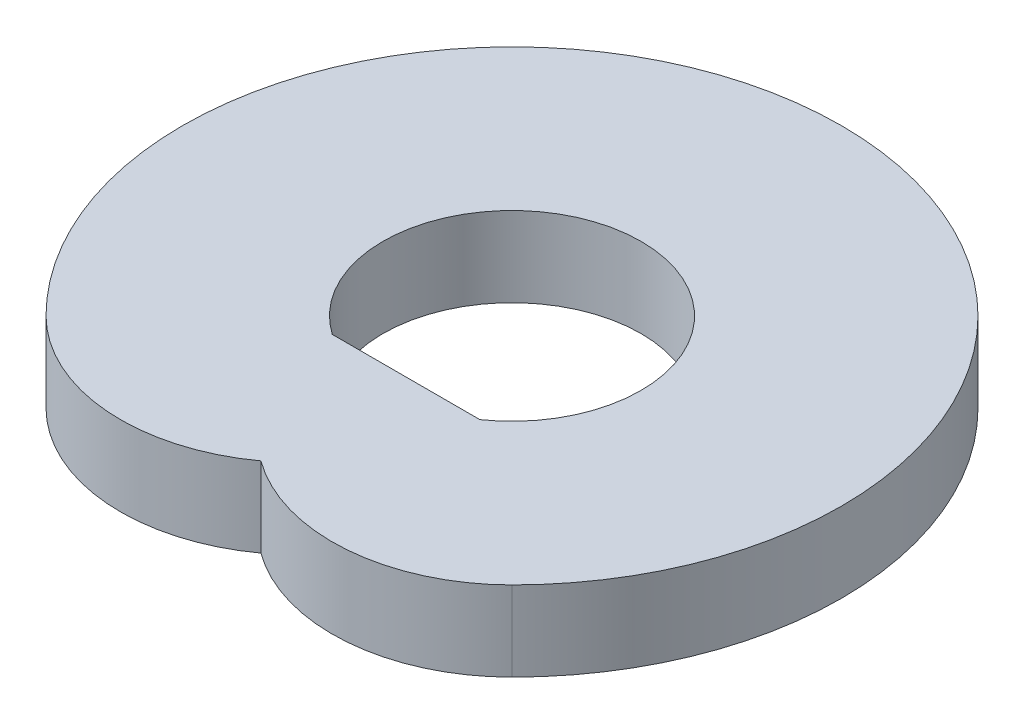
from build123d import *

# Parameters (mm, degrees)
EXTRUDE_1_DEPTH = 200


with BuildPart() as part:
    # Sketch 1 → Extrude 1 (new body)
    with BuildSketch(Plane(origin=(0, 0, 0), x_dir=(1, 0, 0), z_dir=(0, 1, 0))):
        with BuildLine():
            ThreePointArc((583.363094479, -583.363094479), (0, 825), (-583.363094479, -583.363094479))
            ThreePointArc((-583.363094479, -583.363094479), (-300.063671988, -713.809763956), (0, -628.741032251))
            ThreePointArc((0, -628.741032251), (300.063671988, -713.809763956), (583.363094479, -583.363094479))
        make_face()
        with BuildLine():
            Line((184.834957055, -265.165042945), (-184.834957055, -265.165042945))
            ThreePointArc((-184.834957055, -265.165042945), (0, 323.22818774), (184.834957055, -265.165042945))
        make_face(mode=Mode.SUBTRACT)
    extrude(amount=EXTRUDE_1_DEPTH)


solid = part.part
